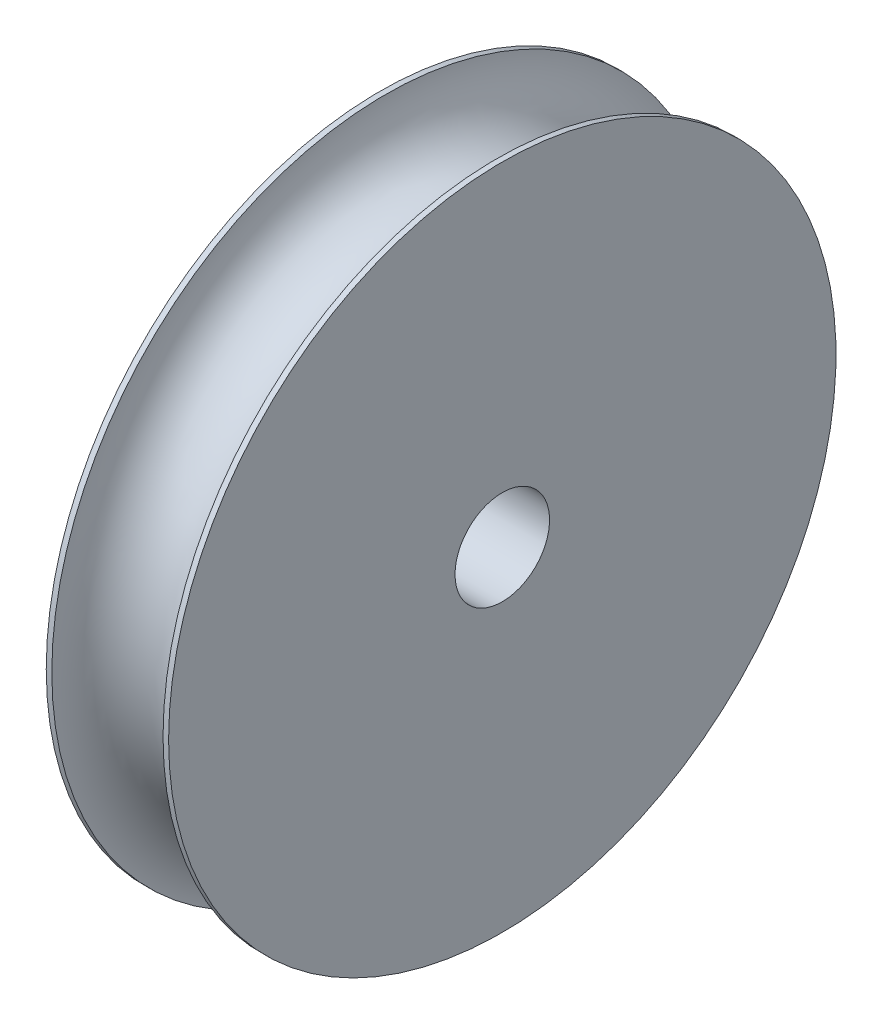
ISO-10303-21;
HEADER;
FILE_DESCRIPTION(('STEP AP214'),'2;1');
FILE_NAME('part.step','',(''),(''),'','','');
FILE_SCHEMA(('AUTOMOTIVE_DESIGN { 1 0 10303 214 1 1 1 1 }'));
ENDSEC;
DATA;
#1=APPLICATION_CONTEXT('core data for automotive mechanical design processes');
#2=APPLICATION_PROTOCOL_DEFINITION('international standard','automotive_design',2000,#1);
#3=PRODUCT_CONTEXT('',#1,'mechanical');
#4=PRODUCT('Part','Part','',(#3));
#5=PRODUCT_RELATED_PRODUCT_CATEGORY('part','',(#4));
#6=PRODUCT_DEFINITION_FORMATION('','',#4);
#7=PRODUCT_DEFINITION_CONTEXT('part definition',#1,'design');
#8=PRODUCT_DEFINITION('design','',#6,#7);
#9=PRODUCT_DEFINITION_SHAPE('','',#8);
#10=(LENGTH_UNIT() NAMED_UNIT(*) SI_UNIT(.MILLI.,.METRE.));
#11=(NAMED_UNIT(*) PLANE_ANGLE_UNIT() SI_UNIT($,.RADIAN.));
#12=(NAMED_UNIT(*) SI_UNIT($,.STERADIAN.) SOLID_ANGLE_UNIT());
#13=UNCERTAINTY_MEASURE_WITH_UNIT(LENGTH_MEASURE(1.E-05),#10,'distance_accuracy_value','');
#14=(GEOMETRIC_REPRESENTATION_CONTEXT(3) GLOBAL_UNCERTAINTY_ASSIGNED_CONTEXT((#13)) GLOBAL_UNIT_ASSIGNED_CONTEXT((#10,
#11,#12)) REPRESENTATION_CONTEXT('',''));
#15=CARTESIAN_POINT('',(0.,0.,0.));
#16=DIRECTION('',(0.,0.,1.));
#17=DIRECTION('',(1.,0.,0.));
#18=AXIS2_PLACEMENT_3D('',#15,#16,#17);
#19=CARTESIAN_POINT('',(0.,0.,0.));
#20=DIRECTION('',(-1.,0.,0.));
#21=DIRECTION('',(0.,0.,1.));
#22=AXIS2_PLACEMENT_3D('',#19,#20,#21);
#23=CYLINDRICAL_SURFACE('',#22,120.);
#24=CARTESIAN_POINT('',(42.,0.,0.));
#25=DIRECTION('',(-1.,0.,0.));
#26=DIRECTION('',(0.,0.,1.));
#27=AXIS2_PLACEMENT_3D('',#24,#25,#26);
#28=CIRCLE('',#27,120.);
#29=CARTESIAN_POINT('',(42.,0.,120.));
#30=VERTEX_POINT('',#29);
#31=EDGE_CURVE('E12',#30,#30,#28,.T.);
#32=ORIENTED_EDGE('',*,*,#31,.F.);
#33=EDGE_LOOP('',(#32));
#34=FACE_BOUND('',#33,.T.);
#35=CARTESIAN_POINT('',(44.,0.,0.));
#36=DIRECTION('',(-1.,0.,0.));
#37=DIRECTION('',(0.,0.,1.));
#38=AXIS2_PLACEMENT_3D('',#35,#36,#37);
#39=CIRCLE('',#38,120.);
#40=CARTESIAN_POINT('',(44.,0.,120.));
#41=VERTEX_POINT('',#40);
#42=EDGE_CURVE('E63',#41,#41,#39,.T.);
#43=ORIENTED_EDGE('',*,*,#42,.T.);
#44=EDGE_LOOP('',(#43));
#45=FACE_BOUND('',#44,.T.);
#46=ADVANCED_FACE('F41',(#34,#45),#23,.T.);
#47=CARTESIAN_POINT('',(22.,0.,0.));
#48=DIRECTION('',(-1.,0.,0.));
#49=DIRECTION('',(0.,0.,1.));
#50=AXIS2_PLACEMENT_3D('',#47,#48,#49);
#51=TOROIDAL_SURFACE('',#50,120.,20.);
#52=CARTESIAN_POINT('',(2.,0.,0.));
#53=DIRECTION('',(-1.,0.,0.));
#54=DIRECTION('',(0.,0.,1.));
#55=AXIS2_PLACEMENT_3D('',#52,#53,#54);
#56=CIRCLE('',#55,120.);
#57=CARTESIAN_POINT('',(2.,0.,120.));
#58=VERTEX_POINT('',#57);
#59=EDGE_CURVE('E47',#58,#58,#56,.T.);
#60=ORIENTED_EDGE('',*,*,#59,.F.);
#61=EDGE_LOOP('',(#60));
#62=FACE_BOUND('',#61,.T.);
#63=ORIENTED_EDGE('',*,*,#31,.T.);
#64=EDGE_LOOP('',(#63));
#65=FACE_BOUND('',#64,.T.);
#66=ADVANCED_FACE('F88',(#62,#65),#51,.F.);
#67=CARTESIAN_POINT('',(0.,0.,0.));
#68=DIRECTION('',(-1.,0.,0.));
#69=DIRECTION('',(0.,0.,1.));
#70=AXIS2_PLACEMENT_3D('',#67,#68,#69);
#71=CYLINDRICAL_SURFACE('',#70,120.);
#72=CARTESIAN_POINT('',(0.,0.,0.));
#73=DIRECTION('',(-1.,0.,0.));
#74=DIRECTION('',(0.,0.,1.));
#75=AXIS2_PLACEMENT_3D('',#72,#73,#74);
#76=CIRCLE('',#75,120.);
#77=CARTESIAN_POINT('',(0.,0.,120.));
#78=VERTEX_POINT('',#77);
#79=EDGE_CURVE('E51',#78,#78,#76,.T.);
#80=ORIENTED_EDGE('',*,*,#79,.F.);
#81=EDGE_LOOP('',(#80));
#82=FACE_BOUND('',#81,.T.);
#83=ORIENTED_EDGE('',*,*,#59,.T.);
#84=EDGE_LOOP('',(#83));
#85=FACE_BOUND('',#84,.T.);
#86=ADVANCED_FACE('F83',(#82,#85),#71,.T.);
#87=CARTESIAN_POINT('',(0.,17.,0.));
#88=DIRECTION('',(1.,0.,0.));
#89=DIRECTION('',(0.,0.,-1.));
#90=AXIS2_PLACEMENT_3D('',#87,#88,#89);
#91=PLANE('',#90);
#92=CARTESIAN_POINT('',(0.,0.,0.));
#93=DIRECTION('',(-1.,0.,0.));
#94=DIRECTION('',(0.,0.,1.));
#95=AXIS2_PLACEMENT_3D('',#92,#93,#94);
#96=CIRCLE('',#95,17.);
#97=CARTESIAN_POINT('',(0.,0.,17.));
#98=VERTEX_POINT('',#97);
#99=EDGE_CURVE('E55',#98,#98,#96,.T.);
#100=ORIENTED_EDGE('',*,*,#99,.F.);
#101=EDGE_LOOP('',(#100));
#102=FACE_BOUND('',#101,.T.);
#103=ORIENTED_EDGE('',*,*,#79,.T.);
#104=EDGE_LOOP('',(#103));
#105=FACE_BOUND('',#104,.T.);
#106=ADVANCED_FACE('F77',(#102,#105),#91,.F.);
#107=CARTESIAN_POINT('',(0.,0.,0.));
#108=DIRECTION('',(-1.,0.,0.));
#109=DIRECTION('',(0.,0.,1.));
#110=AXIS2_PLACEMENT_3D('',#107,#108,#109);
#111=CYLINDRICAL_SURFACE('',#110,17.);
#112=CARTESIAN_POINT('',(44.,0.,0.));
#113=DIRECTION('',(-1.,0.,0.));
#114=DIRECTION('',(0.,0.,1.));
#115=AXIS2_PLACEMENT_3D('',#112,#113,#114);
#116=CIRCLE('',#115,17.);
#117=CARTESIAN_POINT('',(44.,0.,17.));
#118=VERTEX_POINT('',#117);
#119=EDGE_CURVE('E60',#118,#118,#116,.T.);
#120=ORIENTED_EDGE('',*,*,#119,.F.);
#121=EDGE_LOOP('',(#120));
#122=FACE_BOUND('',#121,.T.);
#123=ORIENTED_EDGE('',*,*,#99,.T.);
#124=EDGE_LOOP('',(#123));
#125=FACE_BOUND('',#124,.T.);
#126=ADVANCED_FACE('F71',(#122,#125),#111,.F.);
#127=CARTESIAN_POINT('',(44.,120.,0.));
#128=DIRECTION('',(-1.,0.,0.));
#129=DIRECTION('',(0.,0.,1.));
#130=AXIS2_PLACEMENT_3D('',#127,#128,#129);
#131=PLANE('',#130);
#132=ORIENTED_EDGE('',*,*,#42,.F.);
#133=EDGE_LOOP('',(#132));
#134=FACE_BOUND('',#133,.T.);
#135=ORIENTED_EDGE('',*,*,#119,.T.);
#136=EDGE_LOOP('',(#135));
#137=FACE_BOUND('',#136,.T.);
#138=ADVANCED_FACE('F68',(#134,#137),#131,.F.);
#139=CLOSED_SHELL('',(#46,#66,#86,#106,#126,#138));
#140=MANIFOLD_SOLID_BREP('B2',#139);
#141=ADVANCED_BREP_SHAPE_REPRESENTATION('',(#18,#140),#14);
#142=SHAPE_DEFINITION_REPRESENTATION(#9,#141);
ENDSEC;
END-ISO-10303-21;
